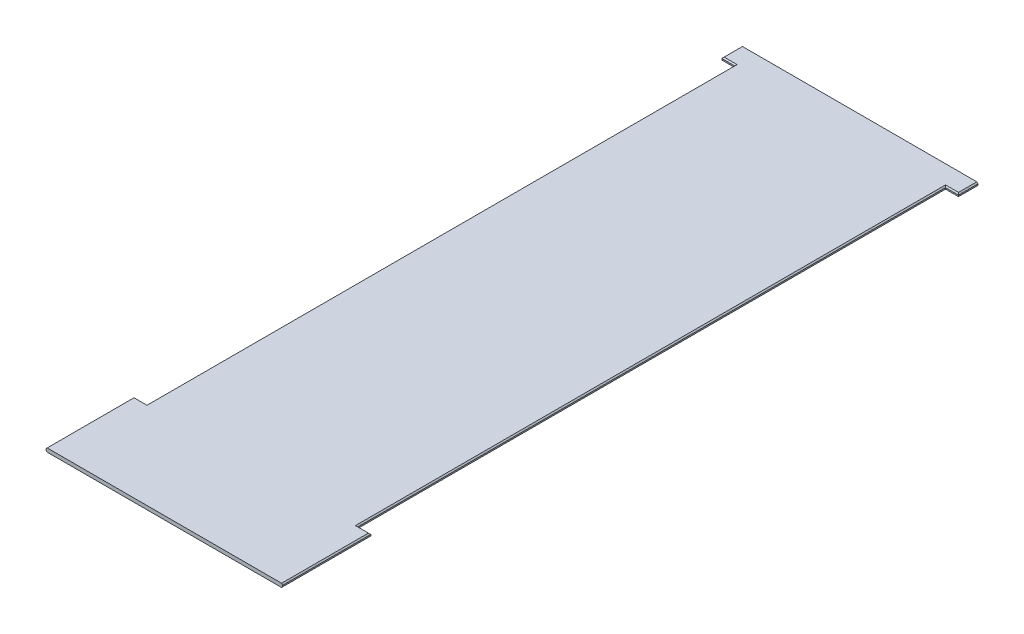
ISO-10303-21;
HEADER;
FILE_DESCRIPTION(('STEP AP214'),'2;1');
FILE_NAME('part.step','',(''),(''),'','','');
FILE_SCHEMA(('AUTOMOTIVE_DESIGN { 1 0 10303 214 1 1 1 1 }'));
ENDSEC;
DATA;
#1=APPLICATION_CONTEXT('core data for automotive mechanical design processes');
#2=APPLICATION_PROTOCOL_DEFINITION('international standard','automotive_design',2000,#1);
#3=PRODUCT_CONTEXT('',#1,'mechanical');
#4=PRODUCT('Part','Part','',(#3));
#5=PRODUCT_RELATED_PRODUCT_CATEGORY('part','',(#4));
#6=PRODUCT_DEFINITION_FORMATION('','',#4);
#7=PRODUCT_DEFINITION_CONTEXT('part definition',#1,'design');
#8=PRODUCT_DEFINITION('design','',#6,#7);
#9=PRODUCT_DEFINITION_SHAPE('','',#8);
#10=(LENGTH_UNIT() NAMED_UNIT(*) SI_UNIT(.MILLI.,.METRE.));
#11=(NAMED_UNIT(*) PLANE_ANGLE_UNIT() SI_UNIT($,.RADIAN.));
#12=(NAMED_UNIT(*) SI_UNIT($,.STERADIAN.) SOLID_ANGLE_UNIT());
#13=UNCERTAINTY_MEASURE_WITH_UNIT(LENGTH_MEASURE(1.E-05),#10,'distance_accuracy_value','');
#14=(GEOMETRIC_REPRESENTATION_CONTEXT(3) GLOBAL_UNCERTAINTY_ASSIGNED_CONTEXT((#13)) GLOBAL_UNIT_ASSIGNED_CONTEXT((#10,
#11,#12)) REPRESENTATION_CONTEXT('',''));
#15=CARTESIAN_POINT('',(0.,0.,0.));
#16=DIRECTION('',(0.,0.,1.));
#17=DIRECTION('',(1.,0.,0.));
#18=AXIS2_PLACEMENT_3D('',#15,#16,#17);
#19=CARTESIAN_POINT('',(553.261641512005,9.525,1566.92811259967));
#20=DIRECTION('',(-1.,0.,0.));
#21=DIRECTION('',(0.,0.,1.));
#22=AXIS2_PLACEMENT_3D('',#19,#20,#21);
#23=PLANE('',#22);
#24=DIRECTION('',(0.,-1.,0.));
#25=VECTOR('',#24,1.);
#26=CARTESIAN_POINT('',(553.261641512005,9.525,2018.12811259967));
#27=LINE('',#26,#25);
#28=CARTESIAN_POINT('',(553.261641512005,3.52500000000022,2018.12811259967));
#29=VERTEX_POINT('',#28);
#30=CARTESIAN_POINT('',(553.261641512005,-3.52499999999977,2018.12811259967));
#31=VERTEX_POINT('',#30);
#32=EDGE_CURVE('E236',#29,#31,#27,.T.);
#33=ORIENTED_EDGE('',*,*,#32,.T.);
#34=DIRECTION('',(0.,0.,-1.));
#35=VECTOR('',#34,1.);
#36=CARTESIAN_POINT('',(553.261641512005,-3.52499999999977,1566.92811259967));
#37=LINE('',#36,#35);
#38=CARTESIAN_POINT('',(553.261641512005,-3.52499999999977,1566.92811259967));
#39=VERTEX_POINT('',#38);
#40=EDGE_CURVE('E11',#31,#39,#37,.T.);
#41=ORIENTED_EDGE('',*,*,#40,.T.);
#42=DIRECTION('',(0.,-1.,0.));
#43=VECTOR('',#42,1.);
#44=CARTESIAN_POINT('',(553.261641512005,9.525,1566.92811259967));
#45=LINE('',#44,#43);
#46=CARTESIAN_POINT('',(553.261641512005,3.52500000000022,1566.92811259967));
#47=VERTEX_POINT('',#46);
#48=EDGE_CURVE('E243',#47,#39,#45,.T.);
#49=ORIENTED_EDGE('',*,*,#48,.F.);
#50=DIRECTION('',(0.,0.,1.));
#51=VECTOR('',#50,1.);
#52=CARTESIAN_POINT('',(553.261641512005,3.52500000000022,1566.92811259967));
#53=LINE('',#52,#51);
#54=EDGE_CURVE('E59',#47,#29,#53,.T.);
#55=ORIENTED_EDGE('',*,*,#54,.T.);
#56=EDGE_LOOP('',(#33,#41,#49,#55));
#57=FACE_BOUND('',#56,.T.);
#58=ADVANCED_FACE('F50',(#57),#23,.F.);
#59=CARTESIAN_POINT('',(486.761641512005,9.525,1566.92811259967));
#60=DIRECTION('',(0.,0.,1.));
#61=DIRECTION('',(1.,0.,0.));
#62=AXIS2_PLACEMENT_3D('',#59,#60,#61);
#63=PLANE('',#62);
#64=ORIENTED_EDGE('',*,*,#48,.T.);
#65=DIRECTION('',(-1.,0.,0.));
#66=VECTOR('',#65,1.);
#67=CARTESIAN_POINT('',(486.761641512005,-3.52499999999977,1566.92811259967));
#68=LINE('',#67,#66);
#69=CARTESIAN_POINT('',(486.761641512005,-3.52499999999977,1566.92811259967));
#70=VERTEX_POINT('',#69);
#71=EDGE_CURVE('E380',#39,#70,#68,.T.);
#72=ORIENTED_EDGE('',*,*,#71,.T.);
#73=DIRECTION('',(0.,-1.,0.));
#74=VECTOR('',#73,1.);
#75=CARTESIAN_POINT('',(486.761641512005,9.525,1566.92811259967));
#76=LINE('',#75,#74);
#77=CARTESIAN_POINT('',(486.761641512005,3.52500000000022,1566.92811259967));
#78=VERTEX_POINT('',#77);
#79=EDGE_CURVE('E248',#78,#70,#76,.T.);
#80=ORIENTED_EDGE('',*,*,#79,.F.);
#81=DIRECTION('',(1.,0.,0.));
#82=VECTOR('',#81,1.);
#83=CARTESIAN_POINT('',(486.761641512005,3.52500000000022,1566.92811259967));
#84=LINE('',#83,#82);
#85=EDGE_CURVE('E73',#78,#47,#84,.T.);
#86=ORIENTED_EDGE('',*,*,#85,.T.);
#87=EDGE_LOOP('',(#64,#72,#80,#86));
#88=FACE_BOUND('',#87,.T.);
#89=ADVANCED_FACE('F620',(#88),#63,.F.);
#90=CARTESIAN_POINT('',(486.761641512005,9.525,-1445.07188740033));
#91=DIRECTION('',(-1.,0.,0.));
#92=DIRECTION('',(0.,0.,1.));
#93=AXIS2_PLACEMENT_3D('',#90,#91,#92);
#94=PLANE('',#93);
#95=ORIENTED_EDGE('',*,*,#79,.T.);
#96=DIRECTION('',(0.,0.,-1.));
#97=VECTOR('',#96,1.);
#98=CARTESIAN_POINT('',(486.761641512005,-3.52499999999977,-1445.07188740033));
#99=LINE('',#98,#97);
#100=CARTESIAN_POINT('',(486.761641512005,-3.52499999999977,-1445.07188740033));
#101=VERTEX_POINT('',#100);
#102=EDGE_CURVE('E375',#70,#101,#99,.T.);
#103=ORIENTED_EDGE('',*,*,#102,.T.);
#104=DIRECTION('',(0.,-1.,0.));
#105=VECTOR('',#104,1.);
#106=CARTESIAN_POINT('',(486.761641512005,9.525,-1445.07188740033));
#107=LINE('',#106,#105);
#108=CARTESIAN_POINT('',(486.761641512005,3.52500000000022,-1445.07188740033));
#109=VERTEX_POINT('',#108);
#110=EDGE_CURVE('E493',#109,#101,#107,.T.);
#111=ORIENTED_EDGE('',*,*,#110,.F.);
#112=DIRECTION('',(0.,0.,1.));
#113=VECTOR('',#112,1.);
#114=CARTESIAN_POINT('',(486.761641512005,3.52500000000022,-1445.07188740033));
#115=LINE('',#114,#113);
#116=EDGE_CURVE('E367',#109,#78,#115,.T.);
#117=ORIENTED_EDGE('',*,*,#116,.T.);
#118=EDGE_LOOP('',(#95,#103,#111,#117));
#119=FACE_BOUND('',#118,.T.);
#120=ADVANCED_FACE('F498',(#119),#94,.F.);
#121=CARTESIAN_POINT('',(486.761641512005,9.525,-1445.07188740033));
#122=DIRECTION('',(0.,0.,-1.));
#123=DIRECTION('',(-1.,0.,0.));
#124=AXIS2_PLACEMENT_3D('',#121,#122,#123);
#125=PLANE('',#124);
#126=ORIENTED_EDGE('',*,*,#110,.T.);
#127=DIRECTION('',(1.,0.,0.));
#128=VECTOR('',#127,1.);
#129=CARTESIAN_POINT('',(553.261641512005,-3.52499999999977,-1445.07188740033));
#130=LINE('',#129,#128);
#131=CARTESIAN_POINT('',(553.261641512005,-3.52499999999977,-1445.07188740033));
#132=VERTEX_POINT('',#131);
#133=EDGE_CURVE('E366',#101,#132,#130,.T.);
#134=ORIENTED_EDGE('',*,*,#133,.T.);
#135=DIRECTION('',(0.,-1.,0.));
#136=VECTOR('',#135,1.);
#137=CARTESIAN_POINT('',(553.261641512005,9.525,-1445.07188740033));
#138=LINE('',#137,#136);
#139=CARTESIAN_POINT('',(553.261641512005,3.52500000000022,-1445.07188740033));
#140=VERTEX_POINT('',#139);
#141=EDGE_CURVE('E487',#140,#132,#138,.T.);
#142=ORIENTED_EDGE('',*,*,#141,.F.);
#143=DIRECTION('',(-1.,0.,0.));
#144=VECTOR('',#143,1.);
#145=CARTESIAN_POINT('',(486.761641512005,3.52500000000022,-1445.07188740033));
#146=LINE('',#145,#144);
#147=EDGE_CURVE('E361',#140,#109,#146,.T.);
#148=ORIENTED_EDGE('',*,*,#147,.T.);
#149=EDGE_LOOP('',(#126,#134,#142,#148));
#150=FACE_BOUND('',#149,.T.);
#151=ADVANCED_FACE('F520',(#150),#125,.F.);
#152=CARTESIAN_POINT('',(553.261641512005,9.525,-1445.07188740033));
#153=DIRECTION('',(-1.,0.,0.));
#154=DIRECTION('',(0.,0.,1.));
#155=AXIS2_PLACEMENT_3D('',#152,#153,#154);
#156=PLANE('',#155);
#157=ORIENTED_EDGE('',*,*,#141,.T.);
#158=DIRECTION('',(0.,0.,-1.));
#159=VECTOR('',#158,1.);
#160=CARTESIAN_POINT('',(553.261641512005,-3.52499999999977,-1545.0718874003));
#161=LINE('',#160,#159);
#162=CARTESIAN_POINT('',(553.261641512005,-3.52499999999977,-1545.0718874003));
#163=VERTEX_POINT('',#162);
#164=EDGE_CURVE('E360',#132,#163,#161,.T.);
#165=ORIENTED_EDGE('',*,*,#164,.T.);
#166=DIRECTION('',(0.,-1.,0.));
#167=VECTOR('',#166,1.);
#168=CARTESIAN_POINT('',(553.261641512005,9.525,-1545.0718874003));
#169=LINE('',#168,#167);
#170=CARTESIAN_POINT('',(553.261641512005,3.52500000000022,-1545.0718874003));
#171=VERTEX_POINT('',#170);
#172=EDGE_CURVE('E481',#171,#163,#169,.T.);
#173=ORIENTED_EDGE('',*,*,#172,.F.);
#174=DIRECTION('',(0.,0.,1.));
#175=VECTOR('',#174,1.);
#176=CARTESIAN_POINT('',(553.261641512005,3.52500000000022,-1445.07188740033));
#177=LINE('',#176,#175);
#178=EDGE_CURVE('E358',#171,#140,#177,.T.);
#179=ORIENTED_EDGE('',*,*,#178,.T.);
#180=EDGE_LOOP('',(#157,#165,#173,#179));
#181=FACE_BOUND('',#180,.T.);
#182=ADVANCED_FACE('F518',(#181),#156,.F.);
#183=CARTESIAN_POINT('',(-659.938358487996,9.525,-1545.0718874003));
#184=DIRECTION('',(0.,0.,1.));
#185=DIRECTION('',(1.,0.,0.));
#186=AXIS2_PLACEMENT_3D('',#183,#184,#185);
#187=PLANE('',#186);
#188=DIRECTION('',(-1.,0.,0.));
#189=VECTOR('',#188,1.);
#190=CARTESIAN_POINT('',(-659.938358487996,-9.525,-1545.0718874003));
#191=LINE('',#190,#189);
#192=CARTESIAN_POINT('',(547.261641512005,-9.525,-1545.0718874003));
#193=VERTEX_POINT('',#192);
#194=CARTESIAN_POINT('',(-653.938358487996,-9.525,-1545.0718874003));
#195=VERTEX_POINT('',#194);
#196=EDGE_CURVE('E399',#193,#195,#191,.T.);
#197=ORIENTED_EDGE('',*,*,#196,.T.);
#198=DIRECTION('',(-0.707106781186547,0.707106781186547,0.));
#199=VECTOR('',#198,1.);
#200=CARTESIAN_POINT('',(-659.938358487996,-3.52499999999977,-1545.0718874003));
#201=LINE('',#200,#199);
#202=CARTESIAN_POINT('',(-659.938358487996,-3.52499999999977,-1545.0718874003));
#203=VERTEX_POINT('',#202);
#204=EDGE_CURVE('E325',#195,#203,#201,.T.);
#205=ORIENTED_EDGE('',*,*,#204,.T.);
#206=DIRECTION('',(0.,-1.,0.));
#207=VECTOR('',#206,1.);
#208=CARTESIAN_POINT('',(-659.938358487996,9.525,-1545.0718874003));
#209=LINE('',#208,#207);
#210=CARTESIAN_POINT('',(-659.938358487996,3.52500000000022,-1545.0718874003));
#211=VERTEX_POINT('',#210);
#212=EDGE_CURVE('E480',#211,#203,#209,.T.);
#213=ORIENTED_EDGE('',*,*,#212,.F.);
#214=DIRECTION('',(-0.707106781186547,-0.707106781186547,0.));
#215=VECTOR('',#214,1.);
#216=CARTESIAN_POINT('',(-653.938358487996,9.525,-1545.0718874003));
#217=LINE('',#216,#215);
#218=CARTESIAN_POINT('',(-653.938358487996,9.525,-1545.0718874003));
#219=VERTEX_POINT('',#218);
#220=EDGE_CURVE('E316',#211,#219,#217,.F.);
#221=ORIENTED_EDGE('',*,*,#220,.T.);
#222=DIRECTION('',(-1.,0.,0.));
#223=VECTOR('',#222,1.);
#224=CARTESIAN_POINT('',(-659.938358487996,9.525,-1545.0718874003));
#225=LINE('',#224,#223);
#226=CARTESIAN_POINT('',(547.261641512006,9.525,-1545.0718874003));
#227=VERTEX_POINT('',#226);
#228=EDGE_CURVE('E460',#227,#219,#225,.T.);
#229=ORIENTED_EDGE('',*,*,#228,.F.);
#230=DIRECTION('',(-0.707106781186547,0.707106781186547,0.));
#231=VECTOR('',#230,1.);
#232=CARTESIAN_POINT('',(547.261641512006,9.525,-1545.0718874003));
#233=LINE('',#232,#231);
#234=EDGE_CURVE('E312',#227,#171,#233,.F.);
#235=ORIENTED_EDGE('',*,*,#234,.T.);
#236=ORIENTED_EDGE('',*,*,#172,.T.);
#237=DIRECTION('',(-0.707106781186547,-0.707106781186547,0.));
#238=VECTOR('',#237,1.);
#239=CARTESIAN_POINT('',(553.261641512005,-3.52499999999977,-1545.0718874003));
#240=LINE('',#239,#238);
#241=EDGE_CURVE('E317',#163,#193,#240,.T.);
#242=ORIENTED_EDGE('',*,*,#241,.T.);
#243=EDGE_LOOP('',(#197,#205,#213,#221,#229,#235,#236,#242));
#244=FACE_BOUND('',#243,.T.);
#245=ADVANCED_FACE('F573',(#244),#187,.F.);
#246=CARTESIAN_POINT('',(-659.938358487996,9.525,-1445.07188740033));
#247=DIRECTION('',(1.,0.,0.));
#248=DIRECTION('',(0.,0.,-1.));
#249=AXIS2_PLACEMENT_3D('',#246,#247,#248);
#250=PLANE('',#249);
#251=ORIENTED_EDGE('',*,*,#212,.T.);
#252=DIRECTION('',(0.,0.,1.));
#253=VECTOR('',#252,1.);
#254=CARTESIAN_POINT('',(-659.938358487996,-3.52499999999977,-1445.07188740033));
#255=LINE('',#254,#253);
#256=CARTESIAN_POINT('',(-659.938358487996,-3.52499999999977,-1445.07188740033));
#257=VERTEX_POINT('',#256);
#258=EDGE_CURVE('E309',#203,#257,#255,.T.);
#259=ORIENTED_EDGE('',*,*,#258,.T.);
#260=DIRECTION('',(0.,-1.,0.));
#261=VECTOR('',#260,1.);
#262=CARTESIAN_POINT('',(-659.938358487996,9.525,-1445.07188740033));
#263=LINE('',#262,#261);
#264=CARTESIAN_POINT('',(-659.938358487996,3.52500000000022,-1445.07188740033));
#265=VERTEX_POINT('',#264);
#266=EDGE_CURVE('E473',#265,#257,#263,.T.);
#267=ORIENTED_EDGE('',*,*,#266,.F.);
#268=DIRECTION('',(0.,0.,-1.));
#269=VECTOR('',#268,1.);
#270=CARTESIAN_POINT('',(-659.938358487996,3.52500000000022,-1445.07188740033));
#271=LINE('',#270,#269);
#272=EDGE_CURVE('E310',#265,#211,#271,.T.);
#273=ORIENTED_EDGE('',*,*,#272,.T.);
#274=EDGE_LOOP('',(#251,#259,#267,#273));
#275=FACE_BOUND('',#274,.T.);
#276=ADVANCED_FACE('F563',(#275),#250,.F.);
#277=CARTESIAN_POINT('',(-593.438358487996,9.525,-1445.07188740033));
#278=DIRECTION('',(0.,0.,-1.));
#279=DIRECTION('',(-1.,0.,0.));
#280=AXIS2_PLACEMENT_3D('',#277,#278,#279);
#281=PLANE('',#280);
#282=ORIENTED_EDGE('',*,*,#266,.T.);
#283=DIRECTION('',(1.,0.,0.));
#284=VECTOR('',#283,1.);
#285=CARTESIAN_POINT('',(-593.438358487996,-3.52499999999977,-1445.07188740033));
#286=LINE('',#285,#284);
#287=CARTESIAN_POINT('',(-593.438358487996,-3.52499999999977,-1445.07188740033));
#288=VERTEX_POINT('',#287);
#289=EDGE_CURVE('E302',#257,#288,#286,.T.);
#290=ORIENTED_EDGE('',*,*,#289,.T.);
#291=DIRECTION('',(0.,-1.,0.));
#292=VECTOR('',#291,1.);
#293=CARTESIAN_POINT('',(-593.438358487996,9.525,-1445.07188740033));
#294=LINE('',#293,#292);
#295=CARTESIAN_POINT('',(-593.438358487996,3.52500000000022,-1445.07188740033));
#296=VERTEX_POINT('',#295);
#297=EDGE_CURVE('E472',#296,#288,#294,.T.);
#298=ORIENTED_EDGE('',*,*,#297,.F.);
#299=DIRECTION('',(-1.,0.,0.));
#300=VECTOR('',#299,1.);
#301=CARTESIAN_POINT('',(-593.438358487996,3.52500000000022,-1445.07188740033));
#302=LINE('',#301,#300);
#303=EDGE_CURVE('E301',#296,#265,#302,.T.);
#304=ORIENTED_EDGE('',*,*,#303,.T.);
#305=EDGE_LOOP('',(#282,#290,#298,#304));
#306=FACE_BOUND('',#305,.T.);
#307=ADVANCED_FACE('F559',(#306),#281,.F.);
#308=CARTESIAN_POINT('',(-593.438358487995,9.525,1566.92811259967));
#309=DIRECTION('',(1.,0.,0.));
#310=DIRECTION('',(0.,0.,-1.));
#311=AXIS2_PLACEMENT_3D('',#308,#309,#310);
#312=PLANE('',#311);
#313=ORIENTED_EDGE('',*,*,#297,.T.);
#314=DIRECTION('',(0.,0.,1.));
#315=VECTOR('',#314,1.);
#316=CARTESIAN_POINT('',(-593.438358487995,-3.52499999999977,1566.92811259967));
#317=LINE('',#316,#315);
#318=CARTESIAN_POINT('',(-593.438358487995,-3.52499999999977,1566.92811259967));
#319=VERTEX_POINT('',#318);
#320=EDGE_CURVE('E296',#288,#319,#317,.T.);
#321=ORIENTED_EDGE('',*,*,#320,.T.);
#322=DIRECTION('',(0.,-1.,0.));
#323=VECTOR('',#322,1.);
#324=CARTESIAN_POINT('',(-593.438358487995,9.525,1566.92811259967));
#325=LINE('',#324,#323);
#326=CARTESIAN_POINT('',(-593.438358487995,3.52500000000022,1566.92811259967));
#327=VERTEX_POINT('',#326);
#328=EDGE_CURVE('E470',#327,#319,#325,.T.);
#329=ORIENTED_EDGE('',*,*,#328,.F.);
#330=DIRECTION('',(0.,0.,-1.));
#331=VECTOR('',#330,1.);
#332=CARTESIAN_POINT('',(-593.438358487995,3.52500000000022,1566.92811259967));
#333=LINE('',#332,#331);
#334=EDGE_CURVE('E294',#327,#296,#333,.T.);
#335=ORIENTED_EDGE('',*,*,#334,.T.);
#336=EDGE_LOOP('',(#313,#321,#329,#335));
#337=FACE_BOUND('',#336,.T.);
#338=ADVANCED_FACE('F548',(#337),#312,.F.);
#339=CARTESIAN_POINT('',(-659.938358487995,9.525,1566.92811259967));
#340=DIRECTION('',(0.,0.,1.));
#341=DIRECTION('',(1.,0.,0.));
#342=AXIS2_PLACEMENT_3D('',#339,#340,#341);
#343=PLANE('',#342);
#344=ORIENTED_EDGE('',*,*,#328,.T.);
#345=DIRECTION('',(-1.,0.,0.));
#346=VECTOR('',#345,1.);
#347=CARTESIAN_POINT('',(-659.938358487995,-3.52499999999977,1566.92811259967));
#348=LINE('',#347,#346);
#349=CARTESIAN_POINT('',(-659.938358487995,-3.52499999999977,1566.92811259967));
#350=VERTEX_POINT('',#349);
#351=EDGE_CURVE('E292',#319,#350,#348,.T.);
#352=ORIENTED_EDGE('',*,*,#351,.T.);
#353=DIRECTION('',(0.,-1.,0.));
#354=VECTOR('',#353,1.);
#355=CARTESIAN_POINT('',(-659.938358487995,9.525,1566.92811259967));
#356=LINE('',#355,#354);
#357=CARTESIAN_POINT('',(-659.938358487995,3.52500000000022,1566.92811259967));
#358=VERTEX_POINT('',#357);
#359=EDGE_CURVE('E232',#358,#350,#356,.T.);
#360=ORIENTED_EDGE('',*,*,#359,.F.);
#361=DIRECTION('',(1.,0.,0.));
#362=VECTOR('',#361,1.);
#363=CARTESIAN_POINT('',(-659.938358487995,3.52500000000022,1566.92811259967));
#364=LINE('',#363,#362);
#365=EDGE_CURVE('E289',#358,#327,#364,.T.);
#366=ORIENTED_EDGE('',*,*,#365,.T.);
#367=EDGE_LOOP('',(#344,#352,#360,#366));
#368=FACE_BOUND('',#367,.T.);
#369=ADVANCED_FACE('F544',(#368),#343,.F.);
#370=CARTESIAN_POINT('',(-659.938358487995,9.525,2018.12811259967));
#371=DIRECTION('',(1.,0.,0.));
#372=DIRECTION('',(0.,0.,-1.));
#373=AXIS2_PLACEMENT_3D('',#370,#371,#372);
#374=PLANE('',#373);
#375=ORIENTED_EDGE('',*,*,#359,.T.);
#376=DIRECTION('',(0.,0.,1.));
#377=VECTOR('',#376,1.);
#378=CARTESIAN_POINT('',(-659.938358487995,-3.52499999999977,2018.12811259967));
#379=LINE('',#378,#377);
#380=CARTESIAN_POINT('',(-659.938358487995,-3.52499999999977,2018.12811259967));
#381=VERTEX_POINT('',#380);
#382=EDGE_CURVE('E231',#350,#381,#379,.T.);
#383=ORIENTED_EDGE('',*,*,#382,.T.);
#384=DIRECTION('',(0.,-1.,0.));
#385=VECTOR('',#384,1.);
#386=CARTESIAN_POINT('',(-659.938358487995,9.525,2018.12811259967));
#387=LINE('',#386,#385);
#388=CARTESIAN_POINT('',(-659.938358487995,3.52500000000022,2018.12811259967));
#389=VERTEX_POINT('',#388);
#390=EDGE_CURVE('E213',#389,#381,#387,.T.);
#391=ORIENTED_EDGE('',*,*,#390,.F.);
#392=DIRECTION('',(0.,0.,-1.));
#393=VECTOR('',#392,1.);
#394=CARTESIAN_POINT('',(-659.938358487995,3.52500000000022,2018.12811259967));
#395=LINE('',#394,#393);
#396=EDGE_CURVE('E229',#389,#358,#395,.T.);
#397=ORIENTED_EDGE('',*,*,#396,.T.);
#398=EDGE_LOOP('',(#375,#383,#391,#397));
#399=FACE_BOUND('',#398,.T.);
#400=ADVANCED_FACE('F230',(#399),#374,.F.);
#401=CARTESIAN_POINT('',(553.261641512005,9.525,2018.12811259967));
#402=DIRECTION('',(0.,0.,-1.));
#403=DIRECTION('',(-1.,0.,0.));
#404=AXIS2_PLACEMENT_3D('',#401,#402,#403);
#405=PLANE('',#404);
#406=ORIENTED_EDGE('',*,*,#390,.T.);
#407=DIRECTION('',(0.707106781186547,-0.707106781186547,0.));
#408=VECTOR('',#407,1.);
#409=CARTESIAN_POINT('',(-659.938358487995,-3.52499999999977,2018.12811259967));
#410=LINE('',#409,#408);
#411=CARTESIAN_POINT('',(-653.938358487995,-9.525,2018.12811259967));
#412=VERTEX_POINT('',#411);
#413=EDGE_CURVE('E221',#381,#412,#410,.T.);
#414=ORIENTED_EDGE('',*,*,#413,.T.);
#415=DIRECTION('',(1.,0.,0.));
#416=VECTOR('',#415,1.);
#417=CARTESIAN_POINT('',(553.261641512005,-9.525,2018.12811259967));
#418=LINE('',#417,#416);
#419=CARTESIAN_POINT('',(547.261641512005,-9.525,2018.12811259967));
#420=VERTEX_POINT('',#419);
#421=EDGE_CURVE('E465',#412,#420,#418,.T.);
#422=ORIENTED_EDGE('',*,*,#421,.T.);
#423=DIRECTION('',(0.707106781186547,0.707106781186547,0.));
#424=VECTOR('',#423,1.);
#425=CARTESIAN_POINT('',(553.261641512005,-3.52499999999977,2018.12811259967));
#426=LINE('',#425,#424);
#427=EDGE_CURVE('E224',#420,#31,#426,.T.);
#428=ORIENTED_EDGE('',*,*,#427,.T.);
#429=ORIENTED_EDGE('',*,*,#32,.F.);
#430=DIRECTION('',(0.707106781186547,-0.707106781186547,0.));
#431=VECTOR('',#430,1.);
#432=CARTESIAN_POINT('',(547.261641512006,9.525,2018.12811259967));
#433=LINE('',#432,#431);
#434=CARTESIAN_POINT('',(547.261641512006,9.525,2018.12811259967));
#435=VERTEX_POINT('',#434);
#436=EDGE_CURVE('E250',#29,#435,#433,.F.);
#437=ORIENTED_EDGE('',*,*,#436,.T.);
#438=DIRECTION('',(1.,0.,0.));
#439=VECTOR('',#438,1.);
#440=CARTESIAN_POINT('',(553.261641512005,9.525,2018.12811259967));
#441=LINE('',#440,#439);
#442=CARTESIAN_POINT('',(-653.938358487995,9.525,2018.12811259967));
#443=VERTEX_POINT('',#442);
#444=EDGE_CURVE('E219',#443,#435,#441,.T.);
#445=ORIENTED_EDGE('',*,*,#444,.F.);
#446=DIRECTION('',(0.707106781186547,0.707106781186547,0.));
#447=VECTOR('',#446,1.);
#448=CARTESIAN_POINT('',(-653.938358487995,9.525,2018.12811259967));
#449=LINE('',#448,#447);
#450=EDGE_CURVE('E215',#443,#389,#449,.F.);
#451=ORIENTED_EDGE('',*,*,#450,.T.);
#452=EDGE_LOOP('',(#406,#414,#422,#428,#429,#437,#445,#451));
#453=FACE_BOUND('',#452,.T.);
#454=ADVANCED_FACE('F211',(#453),#405,.F.);
#455=CARTESIAN_POINT('',(0.,9.525,0.));
#456=DIRECTION('',(0.,-1.,0.));
#457=DIRECTION('',(0.,0.,-1.));
#458=AXIS2_PLACEMENT_3D('',#455,#456,#457);
#459=PLANE('',#458);
#460=DIRECTION('',(-1.,0.,0.));
#461=VECTOR('',#460,1.);
#462=CARTESIAN_POINT('',(0.,9.525,1572.92811259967));
#463=LINE('',#462,#461);
#464=CARTESIAN_POINT('',(-587.438358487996,9.525,1572.92811259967));
#465=VERTEX_POINT('',#464);
#466=CARTESIAN_POINT('',(-653.938358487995,9.525,1572.92811259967));
#467=VERTEX_POINT('',#466);
#468=EDGE_CURVE('E346',#465,#467,#463,.T.);
#469=ORIENTED_EDGE('',*,*,#468,.T.);
#470=DIRECTION('',(0.,0.,1.));
#471=VECTOR('',#470,1.);
#472=CARTESIAN_POINT('',(-653.938358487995,9.525,0.));
#473=LINE('',#472,#471);
#474=EDGE_CURVE('E351',#467,#443,#473,.T.);
#475=ORIENTED_EDGE('',*,*,#474,.T.);
#476=ORIENTED_EDGE('',*,*,#444,.T.);
#477=DIRECTION('',(0.,0.,-1.));
#478=VECTOR('',#477,1.);
#479=CARTESIAN_POINT('',(547.261641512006,9.525,0.));
#480=LINE('',#479,#478);
#481=CARTESIAN_POINT('',(547.261641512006,9.525,1572.92811259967));
#482=VERTEX_POINT('',#481);
#483=EDGE_CURVE('E323',#435,#482,#480,.T.);
#484=ORIENTED_EDGE('',*,*,#483,.T.);
#485=DIRECTION('',(-1.,0.,0.));
#486=VECTOR('',#485,1.);
#487=CARTESIAN_POINT('',(0.,9.525,1572.92811259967));
#488=LINE('',#487,#486);
#489=CARTESIAN_POINT('',(480.761641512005,9.525,1572.92811259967));
#490=VERTEX_POINT('',#489);
#491=EDGE_CURVE('E327',#482,#490,#488,.T.);
#492=ORIENTED_EDGE('',*,*,#491,.T.);
#493=DIRECTION('',(0.,0.,-1.));
#494=VECTOR('',#493,1.);
#495=CARTESIAN_POINT('',(480.761641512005,9.525,0.));
#496=LINE('',#495,#494);
#497=CARTESIAN_POINT('',(480.761641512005,9.525,-1451.07188740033));
#498=VERTEX_POINT('',#497);
#499=EDGE_CURVE('E333',#490,#498,#496,.T.);
#500=ORIENTED_EDGE('',*,*,#499,.T.);
#501=DIRECTION('',(1.,0.,0.));
#502=VECTOR('',#501,1.);
#503=CARTESIAN_POINT('',(0.,9.525,-1451.07188740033));
#504=LINE('',#503,#502);
#505=CARTESIAN_POINT('',(547.261641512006,9.525,-1451.07188740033));
#506=VERTEX_POINT('',#505);
#507=EDGE_CURVE('E334',#498,#506,#504,.T.);
#508=ORIENTED_EDGE('',*,*,#507,.T.);
#509=DIRECTION('',(0.,0.,-1.));
#510=VECTOR('',#509,1.);
#511=CARTESIAN_POINT('',(547.261641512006,9.525,0.));
#512=LINE('',#511,#510);
#513=EDGE_CURVE('E340',#506,#227,#512,.T.);
#514=ORIENTED_EDGE('',*,*,#513,.T.);
#515=ORIENTED_EDGE('',*,*,#228,.T.);
#516=DIRECTION('',(0.,0.,1.));
#517=VECTOR('',#516,1.);
#518=CARTESIAN_POINT('',(-653.938358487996,9.525,0.));
#519=LINE('',#518,#517);
#520=CARTESIAN_POINT('',(-653.938358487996,9.525,-1451.07188740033));
#521=VERTEX_POINT('',#520);
#522=EDGE_CURVE('E342',#219,#521,#519,.T.);
#523=ORIENTED_EDGE('',*,*,#522,.T.);
#524=DIRECTION('',(1.,0.,0.));
#525=VECTOR('',#524,1.);
#526=CARTESIAN_POINT('',(0.,9.525,-1451.07188740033));
#527=LINE('',#526,#525);
#528=CARTESIAN_POINT('',(-587.438358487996,9.525,-1451.07188740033));
#529=VERTEX_POINT('',#528);
#530=EDGE_CURVE('E341',#521,#529,#527,.T.);
#531=ORIENTED_EDGE('',*,*,#530,.T.);
#532=DIRECTION('',(0.,0.,1.));
#533=VECTOR('',#532,1.);
#534=CARTESIAN_POINT('',(-587.438358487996,9.525,0.));
#535=LINE('',#534,#533);
#536=EDGE_CURVE('E349',#529,#465,#535,.T.);
#537=ORIENTED_EDGE('',*,*,#536,.T.);
#538=EDGE_LOOP('',(#469,#475,#476,#484,#492,#500,#508,#514,#515,#523,#531,#537));
#539=FACE_BOUND('',#538,.T.);
#540=ADVANCED_FACE('F531',(#539),#459,.F.);
#541=CARTESIAN_POINT('',(0.,-9.525,0.));
#542=DIRECTION('',(0.,-1.,0.));
#543=DIRECTION('',(0.,0.,-1.));
#544=AXIS2_PLACEMENT_3D('',#541,#542,#543);
#545=PLANE('',#544);
#546=ORIENTED_EDGE('',*,*,#421,.F.);
#547=DIRECTION('',(0.,0.,-1.));
#548=VECTOR('',#547,1.);
#549=CARTESIAN_POINT('',(-653.938358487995,-9.525,1566.92811259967));
#550=LINE('',#549,#548);
#551=CARTESIAN_POINT('',(-653.938358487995,-9.525,1572.92811259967));
#552=VERTEX_POINT('',#551);
#553=EDGE_CURVE('E288',#412,#552,#550,.T.);
#554=ORIENTED_EDGE('',*,*,#553,.T.);
#555=DIRECTION('',(1.,0.,0.));
#556=VECTOR('',#555,1.);
#557=CARTESIAN_POINT('',(-593.438358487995,-9.525,1572.92811259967));
#558=LINE('',#557,#556);
#559=CARTESIAN_POINT('',(-587.438358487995,-9.525,1572.92811259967));
#560=VERTEX_POINT('',#559);
#561=EDGE_CURVE('E282',#552,#560,#558,.T.);
#562=ORIENTED_EDGE('',*,*,#561,.T.);
#563=DIRECTION('',(0.,0.,-1.));
#564=VECTOR('',#563,1.);
#565=CARTESIAN_POINT('',(-587.438358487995,-9.525,-1445.07188740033));
#566=LINE('',#565,#564);
#567=CARTESIAN_POINT('',(-587.438358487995,-9.525,-1451.07188740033));
#568=VERTEX_POINT('',#567);
#569=EDGE_CURVE('E278',#560,#568,#566,.T.);
#570=ORIENTED_EDGE('',*,*,#569,.T.);
#571=DIRECTION('',(-1.,0.,0.));
#572=VECTOR('',#571,1.);
#573=CARTESIAN_POINT('',(-659.938358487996,-9.525,-1451.07188740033));
#574=LINE('',#573,#572);
#575=CARTESIAN_POINT('',(-653.938358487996,-9.525,-1451.07188740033));
#576=VERTEX_POINT('',#575);
#577=EDGE_CURVE('E280',#568,#576,#574,.T.);
#578=ORIENTED_EDGE('',*,*,#577,.T.);
#579=DIRECTION('',(0.,0.,-1.));
#580=VECTOR('',#579,1.);
#581=CARTESIAN_POINT('',(-653.938358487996,-9.525,-1545.0718874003));
#582=LINE('',#581,#580);
#583=EDGE_CURVE('E274',#576,#195,#582,.T.);
#584=ORIENTED_EDGE('',*,*,#583,.T.);
#585=ORIENTED_EDGE('',*,*,#196,.F.);
#586=DIRECTION('',(0.,0.,1.));
#587=VECTOR('',#586,1.);
#588=CARTESIAN_POINT('',(547.261641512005,-9.525,-1445.07188740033));
#589=LINE('',#588,#587);
#590=CARTESIAN_POINT('',(547.261641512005,-9.525,-1451.07188740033));
#591=VERTEX_POINT('',#590);
#592=EDGE_CURVE('E272',#193,#591,#589,.T.);
#593=ORIENTED_EDGE('',*,*,#592,.T.);
#594=DIRECTION('',(-1.,0.,0.));
#595=VECTOR('',#594,1.);
#596=CARTESIAN_POINT('',(486.761641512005,-9.525,-1451.07188740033));
#597=LINE('',#596,#595);
#598=CARTESIAN_POINT('',(480.761641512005,-9.525,-1451.07188740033));
#599=VERTEX_POINT('',#598);
#600=EDGE_CURVE('E266',#591,#599,#597,.T.);
#601=ORIENTED_EDGE('',*,*,#600,.T.);
#602=DIRECTION('',(0.,0.,1.));
#603=VECTOR('',#602,1.);
#604=CARTESIAN_POINT('',(480.761641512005,-9.525,1566.92811259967));
#605=LINE('',#604,#603);
#606=CARTESIAN_POINT('',(480.761641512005,-9.525,1572.92811259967));
#607=VERTEX_POINT('',#606);
#608=EDGE_CURVE('E261',#599,#607,#605,.T.);
#609=ORIENTED_EDGE('',*,*,#608,.T.);
#610=DIRECTION('',(1.,0.,0.));
#611=VECTOR('',#610,1.);
#612=CARTESIAN_POINT('',(553.261641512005,-9.525,1572.92811259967));
#613=LINE('',#612,#611);
#614=CARTESIAN_POINT('',(547.261641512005,-9.525,1572.92811259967));
#615=VERTEX_POINT('',#614);
#616=EDGE_CURVE('E264',#607,#615,#613,.T.);
#617=ORIENTED_EDGE('',*,*,#616,.T.);
#618=DIRECTION('',(0.,0.,1.));
#619=VECTOR('',#618,1.);
#620=CARTESIAN_POINT('',(547.261641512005,-9.525,2018.12811259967));
#621=LINE('',#620,#619);
#622=EDGE_CURVE('E256',#615,#420,#621,.T.);
#623=ORIENTED_EDGE('',*,*,#622,.T.);
#624=EDGE_LOOP('',(#546,#554,#562,#570,#578,#584,#585,#593,#601,#609,#617,#623));
#625=FACE_BOUND('',#624,.T.);
#626=ADVANCED_FACE('F604',(#625),#545,.T.);
#627=CARTESIAN_POINT('',(-659.938358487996,-3.52499999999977,-1445.07188740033));
#628=DIRECTION('',(-0.707106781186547,-0.707106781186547,0.));
#629=DIRECTION('',(0.,0.,-1.));
#630=AXIS2_PLACEMENT_3D('',#627,#628,#629);
#631=PLANE('',#630);
#632=ORIENTED_EDGE('',*,*,#204,.F.);
#633=ORIENTED_EDGE('',*,*,#583,.F.);
#634=DIRECTION('',(-0.577350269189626,0.577350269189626,0.577350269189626));
#635=VECTOR('',#634,1.);
#636=CARTESIAN_POINT('',(-659.938358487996,-3.52499999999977,-1445.07188740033));
#637=LINE('',#636,#635);
#638=EDGE_CURVE('E391',#257,#576,#637,.F.);
#639=ORIENTED_EDGE('',*,*,#638,.F.);
#640=ORIENTED_EDGE('',*,*,#258,.F.);
#641=EDGE_LOOP('',(#632,#633,#639,#640));
#642=FACE_BOUND('',#641,.T.);
#643=ADVANCED_FACE('F583',(#642),#631,.T.);
#644=CARTESIAN_POINT('',(-593.438358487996,-3.52499999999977,-1445.07188740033));
#645=DIRECTION('',(0.,-0.707106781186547,0.707106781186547));
#646=DIRECTION('',(-1.,0.,0.));
#647=AXIS2_PLACEMENT_3D('',#644,#645,#646);
#648=PLANE('',#647);
#649=ORIENTED_EDGE('',*,*,#638,.T.);
#650=ORIENTED_EDGE('',*,*,#577,.F.);
#651=DIRECTION('',(-0.577350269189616,0.577350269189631,0.577350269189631));
#652=VECTOR('',#651,1.);
#653=CARTESIAN_POINT('',(-1597.43835848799,1000.47500000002,-441.071887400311));
#654=LINE('',#653,#652);
#655=EDGE_CURVE('E393',#288,#568,#654,.F.);
#656=ORIENTED_EDGE('',*,*,#655,.F.);
#657=ORIENTED_EDGE('',*,*,#289,.F.);
#658=EDGE_LOOP('',(#649,#650,#656,#657));
#659=FACE_BOUND('',#658,.T.);
#660=ADVANCED_FACE('F586',(#659),#648,.T.);
#661=CARTESIAN_POINT('',(-593.438358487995,-3.52499999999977,1566.92811259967));
#662=DIRECTION('',(-0.707106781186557,-0.707106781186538,0.));
#663=DIRECTION('',(0.,0.,-1.));
#664=AXIS2_PLACEMENT_3D('',#661,#662,#663);
#665=PLANE('',#664);
#666=ORIENTED_EDGE('',*,*,#655,.T.);
#667=ORIENTED_EDGE('',*,*,#569,.F.);
#668=DIRECTION('',(-0.577350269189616,0.577350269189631,-0.577350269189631));
#669=VECTOR('',#668,1.);
#670=CARTESIAN_POINT('',(-615.605025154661,18.6416666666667,1544.761445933));
#671=LINE('',#670,#669);
#672=EDGE_CURVE('E387',#319,#560,#671,.F.);
#673=ORIENTED_EDGE('',*,*,#672,.F.);
#674=ORIENTED_EDGE('',*,*,#320,.F.);
#675=EDGE_LOOP('',(#666,#667,#673,#674));
#676=FACE_BOUND('',#675,.T.);
#677=ADVANCED_FACE('F591',(#676),#665,.T.);
#678=CARTESIAN_POINT('',(-659.938358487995,-3.52499999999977,1566.92811259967));
#679=DIRECTION('',(0.,-0.707106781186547,-0.707106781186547));
#680=DIRECTION('',(1.,0.,0.));
#681=AXIS2_PLACEMENT_3D('',#678,#679,#680);
#682=PLANE('',#681);
#683=ORIENTED_EDGE('',*,*,#672,.T.);
#684=ORIENTED_EDGE('',*,*,#561,.F.);
#685=DIRECTION('',(-0.577350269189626,0.577350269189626,-0.577350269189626));
#686=VECTOR('',#685,1.);
#687=CARTESIAN_POINT('',(-659.938358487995,-3.52499999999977,1566.92811259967));
#688=LINE('',#687,#686);
#689=EDGE_CURVE('E385',#350,#552,#688,.F.);
#690=ORIENTED_EDGE('',*,*,#689,.F.);
#691=ORIENTED_EDGE('',*,*,#351,.F.);
#692=EDGE_LOOP('',(#683,#684,#690,#691));
#693=FACE_BOUND('',#692,.T.);
#694=ADVANCED_FACE('F596',(#693),#682,.T.);
#695=CARTESIAN_POINT('',(-659.938358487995,-3.52499999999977,2018.12811259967));
#696=DIRECTION('',(-0.707106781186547,-0.707106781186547,0.));
#697=DIRECTION('',(0.,0.,-1.));
#698=AXIS2_PLACEMENT_3D('',#695,#696,#697);
#699=PLANE('',#698);
#700=ORIENTED_EDGE('',*,*,#689,.T.);
#701=ORIENTED_EDGE('',*,*,#553,.F.);
#702=ORIENTED_EDGE('',*,*,#413,.F.);
#703=ORIENTED_EDGE('',*,*,#382,.F.);
#704=EDGE_LOOP('',(#700,#701,#702,#703));
#705=FACE_BOUND('',#704,.T.);
#706=ADVANCED_FACE('F602',(#705),#699,.T.);
#707=CARTESIAN_POINT('',(-653.938358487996,9.525,0.));
#708=DIRECTION('',(0.707106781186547,-0.707106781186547,0.));
#709=DIRECTION('',(0.,0.,1.));
#710=AXIS2_PLACEMENT_3D('',#707,#708,#709);
#711=PLANE('',#710);
#712=ORIENTED_EDGE('',*,*,#220,.F.);
#713=ORIENTED_EDGE('',*,*,#272,.F.);
#714=DIRECTION('',(0.577350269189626,0.577350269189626,-0.577350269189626));
#715=VECTOR('',#714,1.);
#716=CARTESIAN_POINT('',(-1137.62898762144,-474.165629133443,-967.381258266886));
#717=LINE('',#716,#715);
#718=EDGE_CURVE('E390',#521,#265,#717,.F.);
#719=ORIENTED_EDGE('',*,*,#718,.F.);
#720=ORIENTED_EDGE('',*,*,#522,.F.);
#721=EDGE_LOOP('',(#712,#713,#719,#720));
#722=FACE_BOUND('',#721,.T.);
#723=ADVANCED_FACE('F568',(#722),#711,.F.);
#724=CARTESIAN_POINT('',(0.,9.525,-1451.07188740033));
#725=DIRECTION('',(0.,-0.707106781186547,-0.707106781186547));
#726=DIRECTION('',(1.,0.,0.));
#727=AXIS2_PLACEMENT_3D('',#724,#725,#726);
#728=PLANE('',#727);
#729=ORIENTED_EDGE('',*,*,#718,.T.);
#730=ORIENTED_EDGE('',*,*,#303,.F.);
#731=DIRECTION('',(0.577350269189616,0.577350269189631,-0.577350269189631));
#732=VECTOR('',#731,1.);
#733=CARTESIAN_POINT('',(-1071.12898762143,-474.165629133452,-967.381258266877));
#734=LINE('',#733,#732);
#735=EDGE_CURVE('E410',#529,#296,#734,.F.);
#736=ORIENTED_EDGE('',*,*,#735,.F.);
#737=ORIENTED_EDGE('',*,*,#530,.F.);
#738=EDGE_LOOP('',(#729,#730,#736,#737));
#739=FACE_BOUND('',#738,.T.);
#740=ADVANCED_FACE('F554',(#739),#728,.F.);
#741=CARTESIAN_POINT('',(-587.438358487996,9.525,0.));
#742=DIRECTION('',(0.707106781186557,-0.707106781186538,0.));
#743=DIRECTION('',(0.,0.,1.));
#744=AXIS2_PLACEMENT_3D('',#741,#742,#743);
#745=PLANE('',#744);
#746=ORIENTED_EDGE('',*,*,#735,.T.);
#747=ORIENTED_EDGE('',*,*,#334,.F.);
#748=DIRECTION('',(0.577350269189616,0.577350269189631,0.577350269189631));
#749=VECTOR('',#748,1.);
#750=CARTESIAN_POINT('',(-391.625572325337,205.337786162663,1768.74089876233));
#751=LINE('',#750,#749);
#752=EDGE_CURVE('E405',#465,#327,#751,.F.);
#753=ORIENTED_EDGE('',*,*,#752,.F.);
#754=ORIENTED_EDGE('',*,*,#536,.F.);
#755=EDGE_LOOP('',(#746,#747,#753,#754));
#756=FACE_BOUND('',#755,.T.);
#757=ADVANCED_FACE('F547',(#756),#745,.F.);
#758=CARTESIAN_POINT('',(0.,9.525,1572.92811259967));
#759=DIRECTION('',(0.,-0.707106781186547,0.707106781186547));
#760=DIRECTION('',(-1.,0.,0.));
#761=AXIS2_PLACEMENT_3D('',#758,#759,#760);
#762=PLANE('',#761);
#763=ORIENTED_EDGE('',*,*,#752,.T.);
#764=ORIENTED_EDGE('',*,*,#365,.F.);
#765=DIRECTION('',(0.577350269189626,0.577350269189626,0.577350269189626));
#766=VECTOR('',#765,1.);
#767=CARTESIAN_POINT('',(-435.958905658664,227.504452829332,1790.907565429));
#768=LINE('',#767,#766);
#769=EDGE_CURVE('E241',#467,#358,#768,.F.);
#770=ORIENTED_EDGE('',*,*,#769,.F.);
#771=ORIENTED_EDGE('',*,*,#468,.F.);
#772=EDGE_LOOP('',(#763,#764,#770,#771));
#773=FACE_BOUND('',#772,.T.);
#774=ADVANCED_FACE('F536',(#773),#762,.F.);
#775=CARTESIAN_POINT('',(-653.938358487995,9.525,0.));
#776=DIRECTION('',(0.707106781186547,-0.707106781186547,0.));
#777=DIRECTION('',(0.,0.,1.));
#778=AXIS2_PLACEMENT_3D('',#775,#776,#777);
#779=PLANE('',#778);
#780=ORIENTED_EDGE('',*,*,#769,.T.);
#781=ORIENTED_EDGE('',*,*,#396,.F.);
#782=ORIENTED_EDGE('',*,*,#450,.F.);
#783=ORIENTED_EDGE('',*,*,#474,.F.);
#784=EDGE_LOOP('',(#780,#781,#782,#783));
#785=FACE_BOUND('',#784,.T.);
#786=ADVANCED_FACE('F237',(#785),#779,.F.);
#787=CARTESIAN_POINT('',(553.261641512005,-3.52499999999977,1566.92811259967));
#788=DIRECTION('',(0.707106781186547,-0.707106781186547,0.));
#789=DIRECTION('',(0.,0.,1.));
#790=AXIS2_PLACEMENT_3D('',#787,#788,#789);
#791=PLANE('',#790);
#792=ORIENTED_EDGE('',*,*,#427,.F.);
#793=ORIENTED_EDGE('',*,*,#622,.F.);
#794=DIRECTION('',(0.577350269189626,0.577350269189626,-0.577350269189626));
#795=VECTOR('',#794,1.);
#796=CARTESIAN_POINT('',(553.261641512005,-3.52499999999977,1566.92811259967));
#797=LINE('',#796,#795);
#798=EDGE_CURVE('E401',#39,#615,#797,.F.);
#799=ORIENTED_EDGE('',*,*,#798,.F.);
#800=ORIENTED_EDGE('',*,*,#40,.F.);
#801=EDGE_LOOP('',(#792,#793,#799,#800));
#802=FACE_BOUND('',#801,.T.);
#803=ADVANCED_FACE('F609',(#802),#791,.T.);
#804=CARTESIAN_POINT('',(486.761641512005,-3.52499999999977,1566.92811259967));
#805=DIRECTION('',(0.,-0.707106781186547,-0.707106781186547));
#806=DIRECTION('',(1.,0.,0.));
#807=AXIS2_PLACEMENT_3D('',#804,#805,#806);
#808=PLANE('',#807);
#809=ORIENTED_EDGE('',*,*,#798,.T.);
#810=ORIENTED_EDGE('',*,*,#616,.F.);
#811=DIRECTION('',(0.577350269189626,0.577350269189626,-0.577350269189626));
#812=VECTOR('',#811,1.);
#813=CARTESIAN_POINT('',(1490.76164151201,1000.475,562.928112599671));
#814=LINE('',#813,#812);
#815=EDGE_CURVE('E422',#70,#607,#814,.F.);
#816=ORIENTED_EDGE('',*,*,#815,.F.);
#817=ORIENTED_EDGE('',*,*,#71,.F.);
#818=EDGE_LOOP('',(#809,#810,#816,#817));
#819=FACE_BOUND('',#818,.T.);
#820=ADVANCED_FACE('F502',(#819),#808,.T.);
#821=CARTESIAN_POINT('',(486.761641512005,-3.52499999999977,-1445.07188740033));
#822=DIRECTION('',(0.707106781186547,-0.707106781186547,0.));
#823=DIRECTION('',(0.,0.,1.));
#824=AXIS2_PLACEMENT_3D('',#821,#822,#823);
#825=PLANE('',#824);
#826=ORIENTED_EDGE('',*,*,#815,.T.);
#827=ORIENTED_EDGE('',*,*,#608,.F.);
#828=DIRECTION('',(0.577350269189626,0.577350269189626,0.577350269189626));
#829=VECTOR('',#828,1.);
#830=CARTESIAN_POINT('',(486.761641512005,-3.52499999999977,-1445.07188740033));
#831=LINE('',#830,#829);
#832=EDGE_CURVE('E416',#101,#599,#831,.F.);
#833=ORIENTED_EDGE('',*,*,#832,.F.);
#834=ORIENTED_EDGE('',*,*,#102,.F.);
#835=EDGE_LOOP('',(#826,#827,#833,#834));
#836=FACE_BOUND('',#835,.T.);
#837=ADVANCED_FACE('F507',(#836),#825,.T.);
#838=CARTESIAN_POINT('',(486.761641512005,-3.52499999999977,-1445.07188740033));
#839=DIRECTION('',(0.,-0.707106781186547,0.707106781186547));
#840=DIRECTION('',(-1.,0.,0.));
#841=AXIS2_PLACEMENT_3D('',#838,#839,#840);
#842=PLANE('',#841);
#843=ORIENTED_EDGE('',*,*,#832,.T.);
#844=ORIENTED_EDGE('',*,*,#600,.F.);
#845=DIRECTION('',(0.577350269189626,0.577350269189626,0.577350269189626));
#846=VECTOR('',#845,1.);
#847=CARTESIAN_POINT('',(531.094974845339,-25.6916666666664,-1467.238554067));
#848=LINE('',#847,#846);
#849=EDGE_CURVE('E415',#132,#591,#848,.F.);
#850=ORIENTED_EDGE('',*,*,#849,.F.);
#851=ORIENTED_EDGE('',*,*,#133,.F.);
#852=EDGE_LOOP('',(#843,#844,#850,#851));
#853=FACE_BOUND('',#852,.T.);
#854=ADVANCED_FACE('F514',(#853),#842,.T.);
#855=CARTESIAN_POINT('',(553.261641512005,-3.52499999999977,-1445.07188740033));
#856=DIRECTION('',(0.707106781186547,-0.707106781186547,0.));
#857=DIRECTION('',(0.,0.,1.));
#858=AXIS2_PLACEMENT_3D('',#855,#856,#857);
#859=PLANE('',#858);
#860=ORIENTED_EDGE('',*,*,#849,.T.);
#861=ORIENTED_EDGE('',*,*,#592,.F.);
#862=ORIENTED_EDGE('',*,*,#241,.F.);
#863=ORIENTED_EDGE('',*,*,#164,.F.);
#864=EDGE_LOOP('',(#860,#861,#862,#863));
#865=FACE_BOUND('',#864,.T.);
#866=ADVANCED_FACE('F678',(#865),#859,.T.);
#867=CARTESIAN_POINT('',(547.261641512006,9.525,0.));
#868=DIRECTION('',(-0.707106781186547,-0.707106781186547,0.));
#869=DIRECTION('',(0.,0.,-1.));
#870=AXIS2_PLACEMENT_3D('',#867,#868,#869);
#871=PLANE('',#870);
#872=ORIENTED_EDGE('',*,*,#436,.F.);
#873=ORIENTED_EDGE('',*,*,#54,.F.);
#874=DIRECTION('',(-0.577350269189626,0.577350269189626,0.577350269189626));
#875=VECTOR('',#874,1.);
#876=CARTESIAN_POINT('',(1071.57101237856,-514.784370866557,1048.61874173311));
#877=LINE('',#876,#875);
#878=EDGE_CURVE('E55',#482,#47,#877,.F.);
#879=ORIENTED_EDGE('',*,*,#878,.F.);
#880=ORIENTED_EDGE('',*,*,#483,.F.);
#881=EDGE_LOOP('',(#872,#873,#879,#880));
#882=FACE_BOUND('',#881,.T.);
#883=ADVANCED_FACE('F49',(#882),#871,.F.);
#884=CARTESIAN_POINT('',(0.,9.525,1572.92811259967));
#885=DIRECTION('',(0.,-0.707106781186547,0.707106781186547));
#886=DIRECTION('',(-1.,0.,0.));
#887=AXIS2_PLACEMENT_3D('',#884,#885,#886);
#888=PLANE('',#887);
#889=ORIENTED_EDGE('',*,*,#878,.T.);
#890=ORIENTED_EDGE('',*,*,#85,.F.);
#891=DIRECTION('',(-0.577350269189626,0.577350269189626,0.577350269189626));
#892=VECTOR('',#891,1.);
#893=CARTESIAN_POINT('',(1005.07101237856,-514.784370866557,1048.61874173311));
#894=LINE('',#893,#892);
#895=EDGE_CURVE('E436',#490,#78,#894,.F.);
#896=ORIENTED_EDGE('',*,*,#895,.F.);
#897=ORIENTED_EDGE('',*,*,#491,.F.);
#898=EDGE_LOOP('',(#889,#890,#896,#897));
#899=FACE_BOUND('',#898,.T.);
#900=ADVANCED_FACE('F449',(#899),#888,.F.);
#901=CARTESIAN_POINT('',(480.761641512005,9.525,0.));
#902=DIRECTION('',(-0.707106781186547,-0.707106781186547,0.));
#903=DIRECTION('',(0.,0.,-1.));
#904=AXIS2_PLACEMENT_3D('',#901,#902,#903);
#905=PLANE('',#904);
#906=ORIENTED_EDGE('',*,*,#895,.T.);
#907=ORIENTED_EDGE('',*,*,#116,.F.);
#908=DIRECTION('',(-0.577350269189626,0.577350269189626,-0.577350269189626));
#909=VECTOR('',#908,1.);
#910=CARTESIAN_POINT('',(320.507761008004,169.778880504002,-1611.32576790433));
#911=LINE('',#910,#909);
#912=EDGE_CURVE('E433',#498,#109,#911,.F.);
#913=ORIENTED_EDGE('',*,*,#912,.F.);
#914=ORIENTED_EDGE('',*,*,#499,.F.);
#915=EDGE_LOOP('',(#906,#907,#913,#914));
#916=FACE_BOUND('',#915,.T.);
#917=ADVANCED_FACE('F532',(#916),#905,.F.);
#918=CARTESIAN_POINT('',(0.,9.525,-1451.07188740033));
#919=DIRECTION('',(0.,-0.707106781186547,-0.707106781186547));
#920=DIRECTION('',(1.,0.,0.));
#921=AXIS2_PLACEMENT_3D('',#918,#919,#920);
#922=PLANE('',#921);
#923=ORIENTED_EDGE('',*,*,#912,.T.);
#924=ORIENTED_EDGE('',*,*,#147,.F.);
#925=DIRECTION('',(-0.577350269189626,0.577350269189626,-0.577350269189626));
#926=VECTOR('',#925,1.);
#927=CARTESIAN_POINT('',(364.841094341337,191.945547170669,-1633.492434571));
#928=LINE('',#927,#926);
#929=EDGE_CURVE('E429',#506,#140,#928,.F.);
#930=ORIENTED_EDGE('',*,*,#929,.F.);
#931=ORIENTED_EDGE('',*,*,#507,.F.);
#932=EDGE_LOOP('',(#923,#924,#930,#931));
#933=FACE_BOUND('',#932,.T.);
#934=ADVANCED_FACE('F529',(#933),#922,.F.);
#935=CARTESIAN_POINT('',(547.261641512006,9.525,0.));
#936=DIRECTION('',(-0.707106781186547,-0.707106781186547,0.));
#937=DIRECTION('',(0.,0.,-1.));
#938=AXIS2_PLACEMENT_3D('',#935,#936,#937);
#939=PLANE('',#938);
#940=ORIENTED_EDGE('',*,*,#929,.T.);
#941=ORIENTED_EDGE('',*,*,#178,.F.);
#942=ORIENTED_EDGE('',*,*,#234,.F.);
#943=ORIENTED_EDGE('',*,*,#513,.F.);
#944=EDGE_LOOP('',(#940,#941,#942,#943));
#945=FACE_BOUND('',#944,.T.);
#946=ADVANCED_FACE('F525',(#945),#939,.F.);
#947=CLOSED_SHELL('',(#58,#89,#120,#151,#182,#245,#276,#307,#338,#369,#400,#454,#540,#626,#643,
#660,#677,#694,#706,#723,#740,#757,#774,#786,#803,#820,#837,#854,#866,#883,#900,#917,#934,#946));
#948=MANIFOLD_SOLID_BREP('B2',#947);
#949=ADVANCED_BREP_SHAPE_REPRESENTATION('',(#18,#948),#14);
#950=SHAPE_DEFINITION_REPRESENTATION(#9,#949);
ENDSEC;
END-ISO-10303-21;
